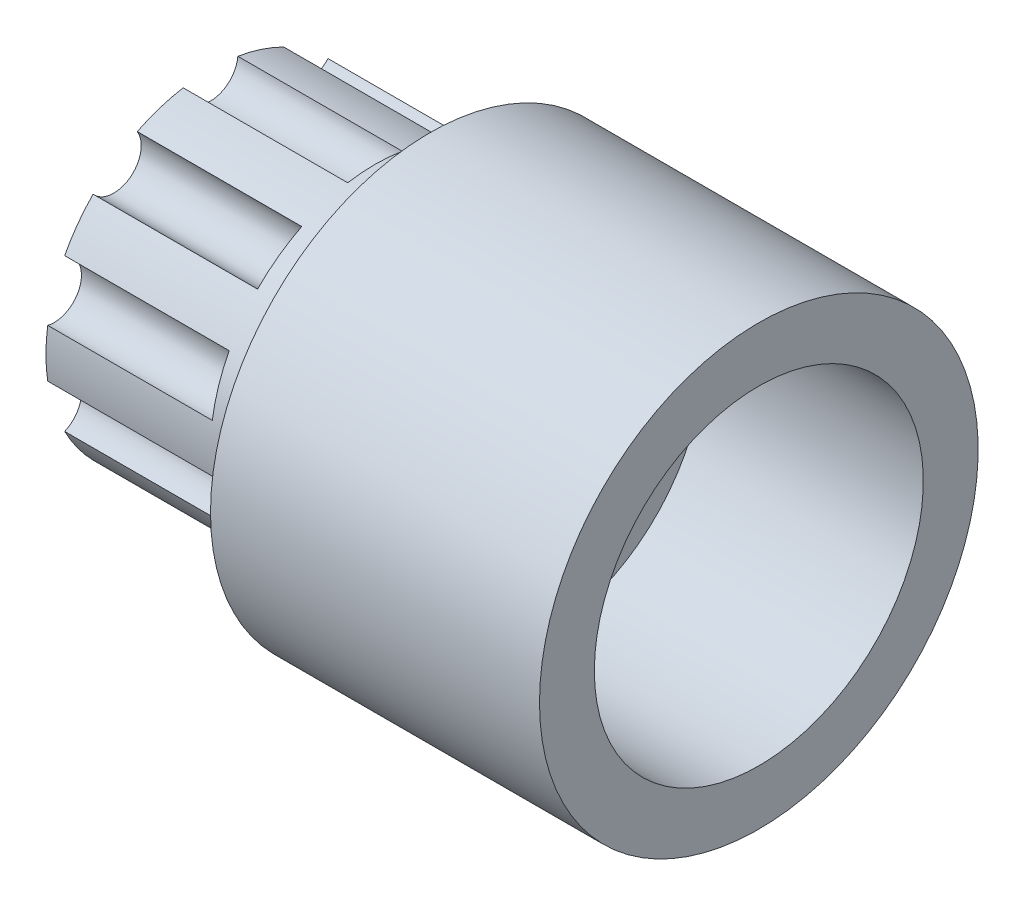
from build123d import *

# Parameters (mm, degrees)
ESQUISSE2_R                  = 0.5
EXTRUSION1_DEPTH             = 3
R_P_TITION_CIRCULAIRE1_COUNT = 10


with BuildPart() as part:
    # Esquisse1 → R_volution1 (revolve)
    with BuildSketch(Plane.XY, mode=Mode.PRIVATE) as r_volution1_sk:
        Polygon((0, 4), (-6, 4), (-6, 3), (-10, 3), (-10, 2), (-4, 2), (-4, 3), (0, 3), align=None)
    revolve(r_volution1_sk.sketch.rotate(Axis((-58.363944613, 0, 0), (1, 0, 0)), 90), axis=Axis((-58.363944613, 0, 0), (1, 0, 0)))

    # Esquisse2 → Extrusion1 (cut)
    with BuildSketch(Plane.ZY.offset(10)):
        with Locations((0, 3)):
            Circle(ESQUISSE2_R)
    extrusion1 = extrude(amount=-EXTRUSION1_DEPTH, mode=Mode.SUBTRACT)

    # R_p_tition circulaire1: Extrusion1 ×10 about axis
    r_p_tition_circulaire1_axis = Axis((0, 0, 0), (1, 0, 0))
    for i in range(1, R_P_TITION_CIRCULAIRE1_COUNT):
        add(extrusion1.rotate(r_p_tition_circulaire1_axis, i * 360 / R_P_TITION_CIRCULAIRE1_COUNT), mode=Mode.SUBTRACT)


solid = part.part
